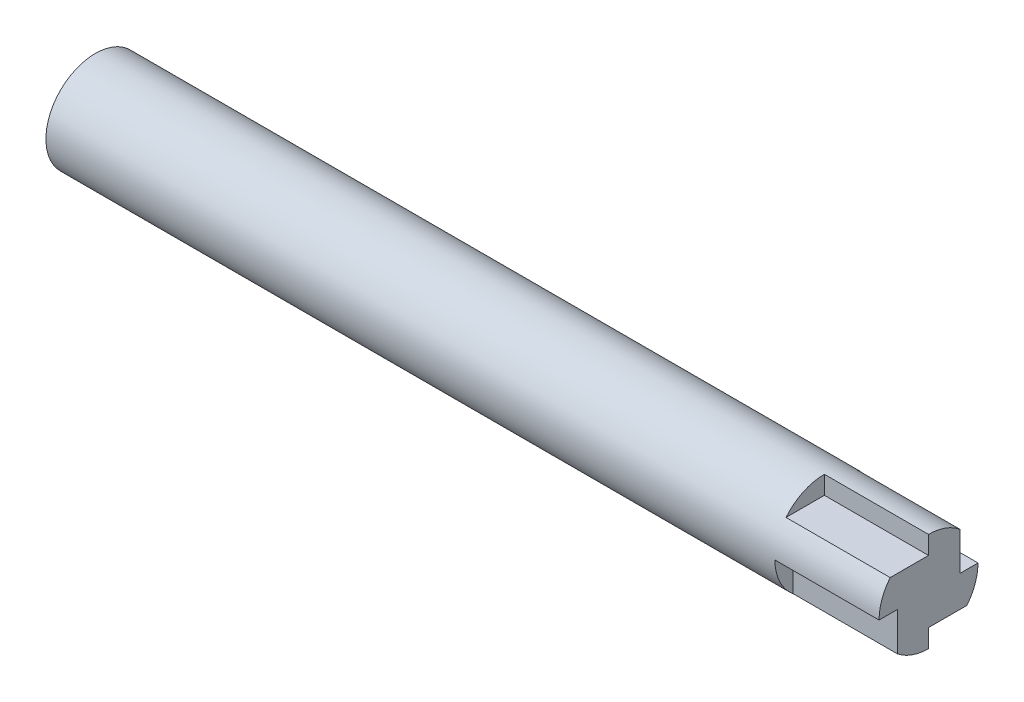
from build123d import *

# Parameters (mm, degrees)
SKETCH1_R           = 12.065
BOSS_EXTRUDE1_DEPTH = 203.2
CUT_EXTRUDE1_START  = -25.4
CUT_EXTRUDE1_DEPTH  = 25.4
CIRPATTERN1_COUNT   = 4


with BuildPart() as part:
    # Sketch1 → Boss-Extrude1 (new body)
    with BuildSketch(Plane(origin=(0, 0, 0), x_dir=(0, 0, -1), z_dir=(1, 0, 0))):
        Circle(SKETCH1_R)
    extrude(amount=BOSS_EXTRUDE1_DEPTH)

    # Sketch2 → Cut-Extrude1 (cut)
    with BuildSketch(Plane(origin=(203.2, 0, 0), x_dir=(0, 0, -1), z_dir=(1, 0, 0)).offset(CUT_EXTRUDE1_START)):
        with BuildLine():
            Line((-9.354134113, 7.62), (0, 7.62))
            Line((0, 7.62), (0, 12.065))
            ThreePointArc((0, 12.065), (-5.178268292, 10.897236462), (-9.354134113, 7.62))
        make_face()
    cut_extrude1 = extrude(amount=CUT_EXTRUDE1_DEPTH, mode=Mode.SUBTRACT)

    # CirPattern1: Cut-Extrude1 ×4 about axis
    cirpattern1_axis = Axis((0, 0, 0), (1, 0, 0))
    for i in range(1, CIRPATTERN1_COUNT):
        add(cut_extrude1.rotate(cirpattern1_axis, i * 360 / CIRPATTERN1_COUNT), mode=Mode.SUBTRACT)


solid = part.part
